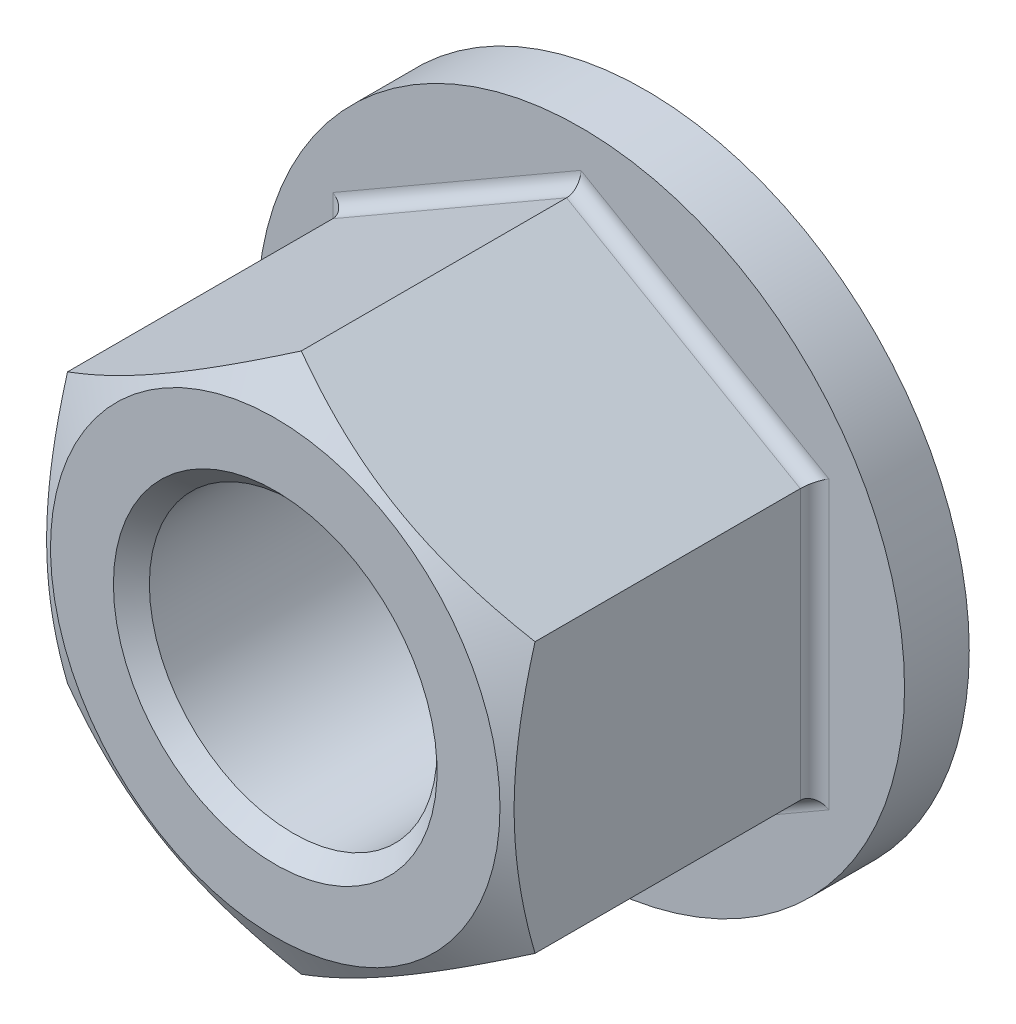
ISO-10303-21;
HEADER;
FILE_DESCRIPTION(('STEP AP214'),'2;1');
FILE_NAME('part.step','',(''),(''),'','','');
FILE_SCHEMA(('AUTOMOTIVE_DESIGN { 1 0 10303 214 1 1 1 1 }'));
ENDSEC;
DATA;
#1=APPLICATION_CONTEXT('core data for automotive mechanical design processes');
#2=APPLICATION_PROTOCOL_DEFINITION('international standard','automotive_design',2000,#1);
#3=PRODUCT_CONTEXT('',#1,'mechanical');
#4=PRODUCT('Part','Part','',(#3));
#5=PRODUCT_RELATED_PRODUCT_CATEGORY('part','',(#4));
#6=PRODUCT_DEFINITION_FORMATION('','',#4);
#7=PRODUCT_DEFINITION_CONTEXT('part definition',#1,'design');
#8=PRODUCT_DEFINITION('design','',#6,#7);
#9=PRODUCT_DEFINITION_SHAPE('','',#8);
#10=(LENGTH_UNIT() NAMED_UNIT(*) SI_UNIT(.MILLI.,.METRE.));
#11=(NAMED_UNIT(*) PLANE_ANGLE_UNIT() SI_UNIT($,.RADIAN.));
#12=(NAMED_UNIT(*) SI_UNIT($,.STERADIAN.) SOLID_ANGLE_UNIT());
#13=UNCERTAINTY_MEASURE_WITH_UNIT(LENGTH_MEASURE(1.E-05),#10,'distance_accuracy_value','');
#14=(GEOMETRIC_REPRESENTATION_CONTEXT(3) GLOBAL_UNCERTAINTY_ASSIGNED_CONTEXT((#13)) GLOBAL_UNIT_ASSIGNED_CONTEXT((#10,
#11,#12)) REPRESENTATION_CONTEXT('',''));
#15=CARTESIAN_POINT('',(0.,0.,0.));
#16=DIRECTION('',(0.,0.,1.));
#17=DIRECTION('',(1.,0.,0.));
#18=AXIS2_PLACEMENT_3D('',#15,#16,#17);
#19=CARTESIAN_POINT('',(-9.,0.,12.));
#20=DIRECTION('',(0.,0.,-1.));
#21=DIRECTION('',(-1.,0.,0.));
#22=AXIS2_PLACEMENT_3D('',#19,#20,#21);
#23=PLANE('',#22);
#24=CARTESIAN_POINT('',(0.,0.,12.));
#25=DIRECTION('',(0.,0.,-1.));
#26=DIRECTION('',(-1.,0.,0.));
#27=AXIS2_PLACEMENT_3D('',#24,#25,#26);
#28=CIRCLE('',#27,4.5);
#29=CARTESIAN_POINT('',(-4.5,0.,12.));
#30=VERTEX_POINT('',#29);
#31=EDGE_CURVE('E242',#30,#30,#28,.T.);
#32=ORIENTED_EDGE('',*,*,#31,.T.);
#33=EDGE_LOOP('',(#32));
#34=FACE_BOUND('',#33,.T.);
#35=CARTESIAN_POINT('',(0.,0.,12.));
#36=DIRECTION('',(0.,0.,1.));
#37=DIRECTION('',(1.,0.,0.));
#38=AXIS2_PLACEMENT_3D('',#35,#36,#37);
#39=CIRCLE('',#38,6.25);
#40=CARTESIAN_POINT('',(6.25,0.,12.));
#41=VERTEX_POINT('',#40);
#42=EDGE_CURVE('E109',#41,#41,#39,.T.);
#43=ORIENTED_EDGE('',*,*,#42,.T.);
#44=EDGE_LOOP('',(#43));
#45=FACE_BOUND('',#44,.T.);
#46=ADVANCED_FACE('F14',(#34,#45),#23,.F.);
#47=CARTESIAN_POINT('',(-6.5,-3.7527767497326,3.5));
#48=DIRECTION('',(-0.5,-0.86602540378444,0.));
#49=DIRECTION('',(0.86602540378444,-0.5,0.));
#50=AXIS2_PLACEMENT_3D('',#47,#48,#49);
#51=PLANE('',#50);
#52=DIRECTION('',(0.,0.,1.));
#53=VECTOR('',#52,1.);
#54=CARTESIAN_POINT('',(-6.5,-3.7527767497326,3.5));
#55=LINE('',#54,#53);
#56=CARTESIAN_POINT('',(-6.5,-3.7527767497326,3.9));
#57=VERTEX_POINT('',#56);
#58=CARTESIAN_POINT('',(-6.5,-3.7527767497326,11.2751058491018));
#59=VERTEX_POINT('',#58);
#60=EDGE_CURVE('E177',#57,#59,#55,.T.);
#61=ORIENTED_EDGE('',*,*,#60,.F.);
#62=DIRECTION('',(0.866025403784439,-0.5,0.));
#63=VECTOR('',#62,1.);
#64=CARTESIAN_POINT('',(0.,-7.50555349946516,3.9));
#65=LINE('',#64,#63);
#66=CARTESIAN_POINT('',(0.,-7.50555349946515,3.9));
#67=VERTEX_POINT('',#66);
#68=EDGE_CURVE('E179',#57,#67,#65,.T.);
#69=ORIENTED_EDGE('',*,*,#68,.T.);
#70=DIRECTION('',(0.,0.,1.));
#71=VECTOR('',#70,1.);
#72=CARTESIAN_POINT('',(0.,-7.50555349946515,3.5));
#73=LINE('',#72,#71);
#74=CARTESIAN_POINT('',(0.,-7.50555349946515,11.2751058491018));
#75=VERTEX_POINT('',#74);
#76=EDGE_CURVE('E91',#67,#75,#73,.T.);
#77=ORIENTED_EDGE('',*,*,#76,.T.);
#78=CARTESIAN_POINT('',(0.0002,-7.505668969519,11.2750391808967));
#79=CARTESIAN_POINT('',(-0.142677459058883,-7.42317863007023,11.3226580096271));
#80=CARTESIAN_POINT('',(-0.286087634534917,-7.34038072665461,11.3681157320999));
#81=CARTESIAN_POINT('',(-0.5740726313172,-7.17411251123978,11.4541137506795));
#82=CARTESIAN_POINT('',(-0.718647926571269,-7.09064192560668,11.4946519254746));
#83=CARTESIAN_POINT('',(-1.15468865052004,-6.83889369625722,11.6080914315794));
#84=CARTESIAN_POINT('',(-1.44787528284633,-6.66962231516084,11.6726146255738));
#85=CARTESIAN_POINT('',(-1.88662374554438,-6.41631077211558,11.7482758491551));
#86=CARTESIAN_POINT('',(-2.0308746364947,-6.33302748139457,11.7698295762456));
#87=CARTESIAN_POINT('',(-2.3200282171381,-6.16608458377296,11.8059721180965));
#88=CARTESIAN_POINT('',(-2.4649308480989,-6.08242501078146,11.8205615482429));
#89=CARTESIAN_POINT('',(-2.75498777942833,-5.91496056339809,11.8424036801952));
#90=CARTESIAN_POINT('',(-2.90014160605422,-5.83115596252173,11.8496647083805));
#91=CARTESIAN_POINT('',(-3.19057533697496,-5.6634739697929,11.8567021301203));
#92=CARTESIAN_POINT('',(-3.33585523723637,-5.57959658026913,11.8564787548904));
#93=CARTESIAN_POINT('',(-3.7338759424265,-5.34979921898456,11.8455789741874));
#94=CARTESIAN_POINT('',(-3.98648646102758,-5.2039544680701,11.8272806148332));
#95=CARTESIAN_POINT('',(-4.49002967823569,-4.91323365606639,11.7692560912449));
#96=CARTESIAN_POINT('',(-4.74096060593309,-4.76835861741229,11.7295100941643));
#97=CARTESIAN_POINT('',(-5.24551722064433,-4.47705272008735,11.6301565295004));
#98=CARTESIAN_POINT('',(-5.49907924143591,-4.33065861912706,11.5701280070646));
#99=CARTESIAN_POINT('',(-6.00242193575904,-4.04005357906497,11.4338874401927));
#100=CARTESIAN_POINT('',(-6.25220905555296,-3.89583891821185,11.357707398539));
#101=CARTESIAN_POINT('',(-6.5002,-3.75266127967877,11.2750391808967));
#102=B_SPLINE_CURVE_WITH_KNOTS('',3,(#78,#79,#80,#81,#82,#83,#84,#85,#86,#87,#88,#89,#90,#91,
#92,#93,#94,#95,#96,#97,#98,#99,#100,#101),.UNSPECIFIED.,.F.,.F.,(4,2,2,2,2,2,2,2,2,2,2,4),(0.,
0.515105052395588,1.03043143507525,2.06322554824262,2.56697389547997,3.07067772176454,
3.57380860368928,4.07692394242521,4.9527935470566,5.82947446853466,6.72559912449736,
7.61996451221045),.UNSPECIFIED.);
#103=EDGE_CURVE('E103',#75,#59,#102,.T.);
#104=ORIENTED_EDGE('',*,*,#103,.T.);
#105=EDGE_LOOP('',(#61,#69,#77,#104));
#106=FACE_BOUND('',#105,.T.);
#107=ADVANCED_FACE('F164',(#106),#51,.T.);
#108=CARTESIAN_POINT('',(-6.5,3.75277674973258,3.5));
#109=DIRECTION('',(-1.,0.,0.));
#110=DIRECTION('',(0.,0.,1.));
#111=AXIS2_PLACEMENT_3D('',#108,#109,#110);
#112=PLANE('',#111);
#113=DIRECTION('',(0.,0.,1.));
#114=VECTOR('',#113,1.);
#115=CARTESIAN_POINT('',(-6.5,3.75277674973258,3.5));
#116=LINE('',#115,#114);
#117=CARTESIAN_POINT('',(-6.5,3.75277674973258,3.9));
#118=VERTEX_POINT('',#117);
#119=CARTESIAN_POINT('',(-6.5,3.75277674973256,11.2751058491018));
#120=VERTEX_POINT('',#119);
#121=EDGE_CURVE('E181',#118,#120,#116,.T.);
#122=ORIENTED_EDGE('',*,*,#121,.F.);
#123=DIRECTION('',(0.,-1.,0.));
#124=VECTOR('',#123,1.);
#125=CARTESIAN_POINT('',(-6.5,-3.7527767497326,3.9));
#126=LINE('',#125,#124);
#127=EDGE_CURVE('E193',#118,#57,#126,.T.);
#128=ORIENTED_EDGE('',*,*,#127,.T.);
#129=ORIENTED_EDGE('',*,*,#60,.T.);
#130=CARTESIAN_POINT('',(-6.5,-10.0336555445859,8.70616314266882));
#131=CARTESIAN_POINT('',(-6.5,-9.75014486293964,8.84350254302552));
#132=CARTESIAN_POINT('',(-6.5,-9.46597830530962,8.97951146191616));
#133=CARTESIAN_POINT('',(-6.5,-8.89598446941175,9.24811908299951));
#134=CARTESIAN_POINT('',(-6.5,-8.61015693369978,9.38071723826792));
#135=CARTESIAN_POINT('',(-6.5,-8.03499695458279,9.64243120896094));
#136=CARTESIAN_POINT('',(-6.5,-7.74565387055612,9.77152372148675));
#137=CARTESIAN_POINT('',(-6.5,-7.16464988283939,10.0243628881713));
#138=CARTESIAN_POINT('',(-6.5,-6.87298909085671,10.1481097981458));
#139=CARTESIAN_POINT('',(-6.5,-6.27765749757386,10.3926353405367));
#140=CARTESIAN_POINT('',(-6.5,-5.97389753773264,10.5131980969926));
#141=CARTESIAN_POINT('',(-6.5,-5.36280630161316,10.7450850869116));
#142=CARTESIAN_POINT('',(-6.5,-5.05547462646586,10.8564082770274));
#143=CARTESIAN_POINT('',(-6.5,-4.43734273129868,11.0668597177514));
#144=CARTESIAN_POINT('',(-6.5,-4.12655114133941,11.1660130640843));
#145=CARTESIAN_POINT('',(-6.5,-3.50050708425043,11.3489111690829));
#146=CARTESIAN_POINT('',(-6.5,-3.18525607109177,11.4326608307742));
#147=CARTESIAN_POINT('',(-6.5,-2.55186849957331,11.5802633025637));
#148=CARTESIAN_POINT('',(-6.5,-2.23375704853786,11.6442221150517));
#149=CARTESIAN_POINT('',(-6.5,-1.59358295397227,11.7485794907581));
#150=CARTESIAN_POINT('',(-6.5,-1.27152067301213,11.7889801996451));
#151=CARTESIAN_POINT('',(-6.5,-0.788883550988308,11.8292288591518));
#152=CARTESIAN_POINT('',(-6.5,-0.629116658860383,11.839252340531));
#153=CARTESIAN_POINT('',(-6.5,-0.309295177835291,11.8525431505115));
#154=CARTESIAN_POINT('',(-6.5,-0.149240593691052,11.8558105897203));
#155=CARTESIAN_POINT('',(-6.5,0.17086186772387,11.8555038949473));
#156=CARTESIAN_POINT('',(-6.5,0.330909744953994,11.8519297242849));
#157=CARTESIAN_POINT('',(-6.5,0.650714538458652,11.8380283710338));
#158=CARTESIAN_POINT('',(-6.5,0.810471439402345,11.8277008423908));
#159=CARTESIAN_POINT('',(-6.5,1.19584370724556,11.7948591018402));
#160=CARTESIAN_POINT('',(-6.5,1.42118493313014,11.7690611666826));
#161=CARTESIAN_POINT('',(-6.5,1.87015348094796,11.7054465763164));
#162=CARTESIAN_POINT('',(-6.5,2.09378055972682,11.6676282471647));
#163=CARTESIAN_POINT('',(-6.5,2.76185802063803,11.5381514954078));
#164=CARTESIAN_POINT('',(-6.5,3.2032468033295,11.4304961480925));
#165=CARTESIAN_POINT('',(-6.5,3.86318247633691,11.2443343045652));
#166=CARTESIAN_POINT('',(-6.5,4.0851654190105,11.1773124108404));
#167=CARTESIAN_POINT('',(-6.5,4.52697435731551,11.0364377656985));
#168=CARTESIAN_POINT('',(-6.5,4.74680033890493,10.9625849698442));
#169=CARTESIAN_POINT('',(-6.5,5.1843670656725,10.809222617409));
#170=CARTESIAN_POINT('',(-6.5,5.40210850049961,10.7297150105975));
#171=CARTESIAN_POINT('',(-6.5,5.83579609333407,10.56596551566));
#172=CARTESIAN_POINT('',(-6.5,6.05174227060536,10.4817236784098));
#173=CARTESIAN_POINT('',(-6.5,6.55408961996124,10.2804224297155));
#174=CARTESIAN_POINT('',(-6.5,6.83987095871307,10.1618192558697));
#175=CARTESIAN_POINT('',(-6.5,7.40906697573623,9.9190479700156));
#176=CARTESIAN_POINT('',(-6.5,7.69248151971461,9.79487954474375));
#177=CARTESIAN_POINT('',(-6.5,8.25736986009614,9.54207515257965));
#178=CARTESIAN_POINT('',(-6.5,8.5388432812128,9.41343834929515));
#179=CARTESIAN_POINT('',(-6.5,9.10012451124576,9.15257463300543));
#180=CARTESIAN_POINT('',(-6.5,9.37993228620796,9.02034764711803));
#181=CARTESIAN_POINT('',(-6.5,9.93842785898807,8.75283283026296));
#182=CARTESIAN_POINT('',(-6.5,10.2171142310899,8.61754202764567));
#183=CARTESIAN_POINT('',(-6.5,10.773300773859,8.3445415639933));
#184=CARTESIAN_POINT('',(-6.5,11.050800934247,8.20683188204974));
#185=CARTESIAN_POINT('',(-6.5,11.8817317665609,7.7907418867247));
#186=CARTESIAN_POINT('',(-6.5,12.4336627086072,7.50936686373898));
#187=CARTESIAN_POINT('',(-6.5,13.4896513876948,6.9641769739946));
#188=CARTESIAN_POINT('',(-6.5,13.993938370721,6.70080419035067));
#189=CARTESIAN_POINT('',(-6.5,15.000633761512,6.17045514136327));
#190=CARTESIAN_POINT('',(-6.5,15.5030421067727,5.90347875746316));
#191=CARTESIAN_POINT('',(-6.5,16.5051942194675,5.36741260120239));
#192=CARTESIAN_POINT('',(-6.5,17.0049414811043,5.09832935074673));
#193=CARTESIAN_POINT('',(-6.5,18.0032306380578,4.55799772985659));
#194=CARTESIAN_POINT('',(-6.5,18.5017725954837,4.2867494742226));
#195=CARTESIAN_POINT('',(-6.5,18.9998688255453,4.01469064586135));
#196=B_SPLINE_CURVE_WITH_KNOTS('',3,(#130,#131,#132,#133,#134,#135,#136,#137,#138,#139,#140,
#141,#142,#143,#144,#145,#146,#147,#148,#149,#150,#151,#152,#153,#154,#155,#156,#157,#158,#159,
#160,#161,#162,#163,#164,#165,#166,#167,#168,#169,#170,#171,#172,#173,#174,#175,#176,#177,#178,
#179,#180,#181,#182,#183,#184,#185,#186,#187,#188,#189,#190,#191,#192,#193,#194,#195),
.UNSPECIFIED.,.F.,.F.,(4,2,2,2,2,2,2,2,2,2,2,2,2,2,2,2,2,2,2,2,2,2,2,2,2,2,2,2,2,2,2,2,4),(0.,
0.945085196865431,1.89032100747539,2.84078217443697,3.79119780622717,4.77151507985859,
5.75194290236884,6.73031372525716,7.70837258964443,8.68109834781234,9.6537354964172,
10.13385737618,10.6139713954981,11.0940879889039,11.5742291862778,12.2542834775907,
12.9344325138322,14.2955041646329,14.9910880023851,15.686676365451,16.382026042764,
17.0773682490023,18.0055347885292,18.933753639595,19.8621471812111,20.7905595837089,
21.7199146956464,22.6492778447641,24.507771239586,26.2145172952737,27.9213196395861,
29.6240699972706,31.326730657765),.UNSPECIFIED.);
#197=EDGE_CURVE('E152',#59,#120,#196,.T.);
#198=ORIENTED_EDGE('',*,*,#197,.T.);
#199=EDGE_LOOP('',(#122,#128,#129,#198));
#200=FACE_BOUND('',#199,.T.);
#201=ADVANCED_FACE('F142',(#200),#112,.T.);
#202=CARTESIAN_POINT('',(0.,7.50555349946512,3.5));
#203=DIRECTION('',(-0.5,0.86602540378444,0.));
#204=DIRECTION('',(-0.86602540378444,-0.5,0.));
#205=AXIS2_PLACEMENT_3D('',#202,#203,#204);
#206=PLANE('',#205);
#207=DIRECTION('',(0.,0.,1.));
#208=VECTOR('',#207,1.);
#209=CARTESIAN_POINT('',(0.,7.50555349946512,3.5));
#210=LINE('',#209,#208);
#211=CARTESIAN_POINT('',(0.,7.50555349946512,3.9));
#212=VERTEX_POINT('',#211);
#213=CARTESIAN_POINT('',(0.,7.50555349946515,11.2751058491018));
#214=VERTEX_POINT('',#213);
#215=EDGE_CURVE('E264',#212,#214,#210,.T.);
#216=ORIENTED_EDGE('',*,*,#215,.F.);
#217=DIRECTION('',(-0.866025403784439,-0.5,0.));
#218=VECTOR('',#217,1.);
#219=CARTESIAN_POINT('',(-6.5,3.75277674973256,3.9));
#220=LINE('',#219,#218);
#221=EDGE_CURVE('E236',#212,#118,#220,.T.);
#222=ORIENTED_EDGE('',*,*,#221,.T.);
#223=ORIENTED_EDGE('',*,*,#121,.T.);
#224=CARTESIAN_POINT('',(-6.5002,3.75266127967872,11.2750391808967));
#225=CARTESIAN_POINT('',(-6.35732254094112,3.83515161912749,11.3226580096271));
#226=CARTESIAN_POINT('',(-6.21391236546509,3.91794952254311,11.3681157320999));
#227=CARTESIAN_POINT('',(-5.9259273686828,4.08421773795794,11.4541137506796));
#228=CARTESIAN_POINT('',(-5.78135207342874,4.16768832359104,11.4946519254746));
#229=CARTESIAN_POINT('',(-5.34531134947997,4.4194365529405,11.6080914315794));
#230=CARTESIAN_POINT('',(-5.05212471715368,4.58870793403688,11.6726146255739));
#231=CARTESIAN_POINT('',(-4.61337625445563,4.84201947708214,11.7482758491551));
#232=CARTESIAN_POINT('',(-4.46912536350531,4.92530276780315,11.7698295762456));
#233=CARTESIAN_POINT('',(-4.17997178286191,5.09224566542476,11.8059721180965));
#234=CARTESIAN_POINT('',(-4.03506915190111,5.17590523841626,11.8205615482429));
#235=CARTESIAN_POINT('',(-3.74501222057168,5.34336968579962,11.8424036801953));
#236=CARTESIAN_POINT('',(-3.59985839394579,5.42717428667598,11.8496647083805));
#237=CARTESIAN_POINT('',(-3.30942466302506,5.59485627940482,11.8567021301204));
#238=CARTESIAN_POINT('',(-3.16414476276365,5.67873366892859,11.8564787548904));
#239=CARTESIAN_POINT('',(-2.76612405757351,5.90853103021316,11.8455789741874));
#240=CARTESIAN_POINT('',(-2.51351353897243,6.05437578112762,11.8272806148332));
#241=CARTESIAN_POINT('',(-2.00997032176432,6.34509659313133,11.7692560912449));
#242=CARTESIAN_POINT('',(-1.75903939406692,6.48997163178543,11.7295100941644));
#243=CARTESIAN_POINT('',(-1.25448277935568,6.78127752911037,11.6301565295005));
#244=CARTESIAN_POINT('',(-1.00092075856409,6.92767163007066,11.5701280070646));
#245=CARTESIAN_POINT('',(-0.497578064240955,7.21827667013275,11.4338874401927));
#246=CARTESIAN_POINT('',(-0.247790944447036,7.36249133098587,11.357707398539));
#247=CARTESIAN_POINT('',(0.000199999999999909,7.50566896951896,11.2750391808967));
#248=B_SPLINE_CURVE_WITH_KNOTS('',3,(#224,#225,#226,#227,#228,#229,#230,#231,#232,#233,#234,
#235,#236,#237,#238,#239,#240,#241,#242,#243,#244,#245,#246,#247),.UNSPECIFIED.,.F.,.F.,(4,2,2,
2,2,2,2,2,2,2,2,4),(0.,0.515105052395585,1.03043143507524,2.06322554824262,2.56697389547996,
3.07067772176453,3.57380860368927,4.07692394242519,4.9527935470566,5.82947446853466,
6.72559912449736,7.61996451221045),.UNSPECIFIED.);
#249=EDGE_CURVE('E111',#120,#214,#248,.T.);
#250=ORIENTED_EDGE('',*,*,#249,.T.);
#251=EDGE_LOOP('',(#216,#222,#223,#250));
#252=FACE_BOUND('',#251,.T.);
#253=ADVANCED_FACE('F137',(#252),#206,.T.);
#254=CARTESIAN_POINT('',(6.5,3.75277674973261,3.5));
#255=DIRECTION('',(0.5,0.866025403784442,0.));
#256=DIRECTION('',(-0.866025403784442,0.5,0.));
#257=AXIS2_PLACEMENT_3D('',#254,#255,#256);
#258=PLANE('',#257);
#259=DIRECTION('',(0.,0.,1.));
#260=VECTOR('',#259,1.);
#261=CARTESIAN_POINT('',(6.5,3.75277674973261,3.5));
#262=LINE('',#261,#260);
#263=CARTESIAN_POINT('',(6.5,3.75277674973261,3.9));
#264=VERTEX_POINT('',#263);
#265=CARTESIAN_POINT('',(6.5,3.75277674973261,11.2751058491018));
#266=VERTEX_POINT('',#265);
#267=EDGE_CURVE('E90',#264,#266,#262,.T.);
#268=ORIENTED_EDGE('',*,*,#267,.F.);
#269=DIRECTION('',(-0.866025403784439,0.5,0.));
#270=VECTOR('',#269,1.);
#271=CARTESIAN_POINT('',(0.,7.50555349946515,3.9));
#272=LINE('',#271,#270);
#273=EDGE_CURVE('E9',#264,#212,#272,.T.);
#274=ORIENTED_EDGE('',*,*,#273,.T.);
#275=ORIENTED_EDGE('',*,*,#215,.T.);
#276=CARTESIAN_POINT('',(-0.000199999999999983,7.505668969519,11.2750391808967));
#277=CARTESIAN_POINT('',(0.142677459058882,7.42317863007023,11.3226580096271));
#278=CARTESIAN_POINT('',(0.286087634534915,7.34038072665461,11.3681157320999));
#279=CARTESIAN_POINT('',(0.574072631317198,7.17411251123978,11.4541137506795));
#280=CARTESIAN_POINT('',(0.718647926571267,7.09064192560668,11.4946519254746));
#281=CARTESIAN_POINT('',(1.15468865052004,6.83889369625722,11.6080914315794));
#282=CARTESIAN_POINT('',(1.44787528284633,6.66962231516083,11.6726146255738));
#283=CARTESIAN_POINT('',(1.88662374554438,6.41631077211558,11.7482758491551));
#284=CARTESIAN_POINT('',(2.0308746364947,6.33302748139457,11.7698295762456));
#285=CARTESIAN_POINT('',(2.3200282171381,6.16608458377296,11.8059721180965));
#286=CARTESIAN_POINT('',(2.4649308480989,6.08242501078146,11.8205615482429));
#287=CARTESIAN_POINT('',(2.75498777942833,5.91496056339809,11.8424036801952));
#288=CARTESIAN_POINT('',(2.90014160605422,5.83115596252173,11.8496647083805));
#289=CARTESIAN_POINT('',(3.19057533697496,5.6634739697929,11.8567021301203));
#290=CARTESIAN_POINT('',(3.33585523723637,5.57959658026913,11.8564787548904));
#291=CARTESIAN_POINT('',(3.73387594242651,5.34979921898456,11.8455789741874));
#292=CARTESIAN_POINT('',(3.98648646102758,5.2039544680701,11.8272806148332));
#293=CARTESIAN_POINT('',(4.49002967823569,4.91323365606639,11.7692560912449));
#294=CARTESIAN_POINT('',(4.74096060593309,4.76835861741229,11.7295100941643));
#295=CARTESIAN_POINT('',(5.24551722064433,4.47705272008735,11.6301565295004));
#296=CARTESIAN_POINT('',(5.49907924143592,4.33065861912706,11.5701280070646));
#297=CARTESIAN_POINT('',(6.00242193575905,4.04005357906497,11.4338874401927));
#298=CARTESIAN_POINT('',(6.25220905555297,3.89583891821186,11.357707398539));
#299=CARTESIAN_POINT('',(6.5002,3.75266127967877,11.2750391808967));
#300=B_SPLINE_CURVE_WITH_KNOTS('',3,(#276,#277,#278,#279,#280,#281,#282,#283,#284,#285,#286,
#287,#288,#289,#290,#291,#292,#293,#294,#295,#296,#297,#298,#299),.UNSPECIFIED.,.F.,.F.,(4,2,2,
2,2,2,2,2,2,2,2,4),(0.,0.515105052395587,1.03043143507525,2.06322554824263,2.56697389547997,
3.07067772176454,3.57380860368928,4.07692394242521,4.95279354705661,5.82947446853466,
6.72559912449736,7.61996451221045),.UNSPECIFIED.);
#301=EDGE_CURVE('E108',#214,#266,#300,.T.);
#302=ORIENTED_EDGE('',*,*,#301,.T.);
#303=EDGE_LOOP('',(#268,#274,#275,#302));
#304=FACE_BOUND('',#303,.T.);
#305=ADVANCED_FACE('F132',(#304),#258,.T.);
#306=CARTESIAN_POINT('',(6.5,-3.75277674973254,3.5));
#307=DIRECTION('',(1.,0.,0.));
#308=DIRECTION('',(0.,0.,-1.));
#309=AXIS2_PLACEMENT_3D('',#306,#307,#308);
#310=PLANE('',#309);
#311=DIRECTION('',(0.,0.,1.));
#312=VECTOR('',#311,1.);
#313=CARTESIAN_POINT('',(6.5,-3.75277674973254,3.5));
#314=LINE('',#313,#312);
#315=CARTESIAN_POINT('',(6.5,-3.75277674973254,3.9));
#316=VERTEX_POINT('',#315);
#317=CARTESIAN_POINT('',(6.5,-3.75277674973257,11.2751058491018));
#318=VERTEX_POINT('',#317);
#319=EDGE_CURVE('E84',#316,#318,#314,.T.);
#320=ORIENTED_EDGE('',*,*,#319,.F.);
#321=DIRECTION('',(0.,1.,0.));
#322=VECTOR('',#321,1.);
#323=CARTESIAN_POINT('',(6.5,3.75277674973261,3.9));
#324=LINE('',#323,#322);
#325=EDGE_CURVE('E23',#316,#264,#324,.T.);
#326=ORIENTED_EDGE('',*,*,#325,.T.);
#327=ORIENTED_EDGE('',*,*,#267,.T.);
#328=CARTESIAN_POINT('',(6.5,-10.0336555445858,8.70616314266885));
#329=CARTESIAN_POINT('',(6.5,-9.75014486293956,8.84350254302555));
#330=CARTESIAN_POINT('',(6.5,-9.46597830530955,8.97951146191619));
#331=CARTESIAN_POINT('',(6.5,-8.89598446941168,9.24811908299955));
#332=CARTESIAN_POINT('',(6.5,-8.61015693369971,9.38071723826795));
#333=CARTESIAN_POINT('',(6.5,-8.03499695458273,9.64243120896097));
#334=CARTESIAN_POINT('',(6.5,-7.74565387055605,9.77152372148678));
#335=CARTESIAN_POINT('',(6.5,-7.16464988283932,10.0243628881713));
#336=CARTESIAN_POINT('',(6.5,-6.87298909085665,10.1481097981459));
#337=CARTESIAN_POINT('',(6.5,-6.2776574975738,10.3926353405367));
#338=CARTESIAN_POINT('',(6.5,-5.97389753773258,10.5131980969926));
#339=CARTESIAN_POINT('',(6.5,-5.36280630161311,10.7450850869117));
#340=CARTESIAN_POINT('',(6.5,-5.05547462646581,10.8564082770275));
#341=CARTESIAN_POINT('',(6.5,-4.43734273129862,11.0668597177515));
#342=CARTESIAN_POINT('',(6.5,-4.12655114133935,11.1660130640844));
#343=CARTESIAN_POINT('',(6.5,-3.50050708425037,11.3489111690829));
#344=CARTESIAN_POINT('',(6.5,-3.18525607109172,11.4326608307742));
#345=CARTESIAN_POINT('',(6.5,-2.55186849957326,11.5802633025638));
#346=CARTESIAN_POINT('',(6.5,-2.23375704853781,11.6442221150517));
#347=CARTESIAN_POINT('',(6.5,-1.59358295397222,11.7485794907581));
#348=CARTESIAN_POINT('',(6.5,-1.27152067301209,11.7889801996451));
#349=CARTESIAN_POINT('',(6.5,-0.788883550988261,11.8292288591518));
#350=CARTESIAN_POINT('',(6.5,-0.629116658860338,11.839252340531));
#351=CARTESIAN_POINT('',(6.5,-0.309295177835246,11.8525431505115));
#352=CARTESIAN_POINT('',(6.5,-0.149240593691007,11.8558105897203));
#353=CARTESIAN_POINT('',(6.5,0.170861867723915,11.8555038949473));
#354=CARTESIAN_POINT('',(6.5,0.330909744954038,11.8519297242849));
#355=CARTESIAN_POINT('',(6.5,0.650714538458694,11.8380283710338));
#356=CARTESIAN_POINT('',(6.5,0.810471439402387,11.8277008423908));
#357=CARTESIAN_POINT('',(6.5,1.1958437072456,11.7948591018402));
#358=CARTESIAN_POINT('',(6.5,1.42118493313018,11.7690611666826));
#359=CARTESIAN_POINT('',(6.5,1.870153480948,11.7054465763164));
#360=CARTESIAN_POINT('',(6.5,2.09378055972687,11.6676282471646));
#361=CARTESIAN_POINT('',(6.5,2.76185802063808,11.5381514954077));
#362=CARTESIAN_POINT('',(6.5,3.20324680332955,11.4304961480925));
#363=CARTESIAN_POINT('',(6.5,3.86318247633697,11.2443343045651));
#364=CARTESIAN_POINT('',(6.5,4.08516541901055,11.1773124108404));
#365=CARTESIAN_POINT('',(6.5,4.52697435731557,11.0364377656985));
#366=CARTESIAN_POINT('',(6.5,4.74680033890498,10.9625849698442));
#367=CARTESIAN_POINT('',(6.5,5.18436706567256,10.809222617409));
#368=CARTESIAN_POINT('',(6.5,5.40210850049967,10.7297150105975));
#369=CARTESIAN_POINT('',(6.5,5.83579609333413,10.56596551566));
#370=CARTESIAN_POINT('',(6.5,6.05174227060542,10.4817236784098));
#371=CARTESIAN_POINT('',(6.5,6.5540896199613,10.2804224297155));
#372=CARTESIAN_POINT('',(6.5,6.83987095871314,10.1618192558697));
#373=CARTESIAN_POINT('',(6.5,7.4090669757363,9.91904797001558));
#374=CARTESIAN_POINT('',(6.5,7.69248151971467,9.79487954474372));
#375=CARTESIAN_POINT('',(6.5,8.2573698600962,9.54207515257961));
#376=CARTESIAN_POINT('',(6.5,8.53884328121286,9.41343834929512));
#377=CARTESIAN_POINT('',(6.5,9.10012451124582,9.1525746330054));
#378=CARTESIAN_POINT('',(6.5,9.37993228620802,9.020347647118));
#379=CARTESIAN_POINT('',(6.5,9.93842785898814,8.75283283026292));
#380=CARTESIAN_POINT('',(6.5,10.21711423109,8.61754202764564));
#381=CARTESIAN_POINT('',(6.5,10.7733007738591,8.34454156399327));
#382=CARTESIAN_POINT('',(6.5,11.050800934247,8.2068318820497));
#383=CARTESIAN_POINT('',(6.5,11.881731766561,7.79074188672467));
#384=CARTESIAN_POINT('',(6.5,12.4336627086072,7.50936686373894));
#385=CARTESIAN_POINT('',(6.5,13.4896513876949,6.96417697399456));
#386=CARTESIAN_POINT('',(6.5,13.9939383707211,6.70080419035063));
#387=CARTESIAN_POINT('',(6.5,15.0006337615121,6.17045514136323));
#388=CARTESIAN_POINT('',(6.5,15.5030421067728,5.90347875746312));
#389=CARTESIAN_POINT('',(6.5,16.5051942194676,5.36741260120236));
#390=CARTESIAN_POINT('',(6.5,17.0049414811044,5.09832935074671));
#391=CARTESIAN_POINT('',(6.5,18.0032306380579,4.55799772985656));
#392=CARTESIAN_POINT('',(6.5,18.5017725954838,4.28674947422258));
#393=CARTESIAN_POINT('',(6.5,18.9998688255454,4.01469064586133));
#394=B_SPLINE_CURVE_WITH_KNOTS('',3,(#328,#329,#330,#331,#332,#333,#334,#335,#336,#337,#338,
#339,#340,#341,#342,#343,#344,#345,#346,#347,#348,#349,#350,#351,#352,#353,#354,#355,#356,#357,
#358,#359,#360,#361,#362,#363,#364,#365,#366,#367,#368,#369,#370,#371,#372,#373,#374,#375,#376,
#377,#378,#379,#380,#381,#382,#383,#384,#385,#386,#387,#388,#389,#390,#391,#392,#393),
.UNSPECIFIED.,.F.,.F.,(4,2,2,2,2,2,2,2,2,2,2,2,2,2,2,2,2,2,2,2,2,2,2,2,2,2,2,2,2,2,2,2,4),(0.,
0.945085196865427,1.89032100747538,2.84078217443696,3.79119780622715,4.77151507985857,
5.75194290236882,6.73031372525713,7.7083725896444,8.68109834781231,9.65373549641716,
10.13385737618,10.6139713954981,11.0940879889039,11.5742291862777,12.2542834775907,
12.9344325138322,14.2955041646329,14.9910880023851,15.686676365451,16.382026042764,
17.0773682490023,18.0055347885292,18.933753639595,19.8621471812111,20.7905595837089,
21.7199146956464,22.6492778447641,24.507771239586,26.2145172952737,27.9213196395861,
29.6240699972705,31.326730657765),.UNSPECIFIED.);
#395=EDGE_CURVE('E99',#266,#318,#394,.F.);
#396=ORIENTED_EDGE('',*,*,#395,.T.);
#397=EDGE_LOOP('',(#320,#326,#327,#396));
#398=FACE_BOUND('',#397,.T.);
#399=ADVANCED_FACE('F107',(#398),#310,.T.);
#400=CARTESIAN_POINT('',(0.,-7.50555349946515,3.5));
#401=DIRECTION('',(0.5,-0.866025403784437,0.));
#402=DIRECTION('',(0.866025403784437,0.5,0.));
#403=AXIS2_PLACEMENT_3D('',#400,#401,#402);
#404=PLANE('',#403);
#405=ORIENTED_EDGE('',*,*,#76,.F.);
#406=DIRECTION('',(0.866025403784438,0.5,0.));
#407=VECTOR('',#406,1.);
#408=CARTESIAN_POINT('',(6.5,-3.75277674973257,3.9));
#409=LINE('',#408,#407);
#410=EDGE_CURVE('E38',#67,#316,#409,.T.);
#411=ORIENTED_EDGE('',*,*,#410,.T.);
#412=ORIENTED_EDGE('',*,*,#319,.T.);
#413=CARTESIAN_POINT('',(6.5002,-3.75266127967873,11.2750391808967));
#414=CARTESIAN_POINT('',(6.35732254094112,-3.83515161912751,11.3226580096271));
#415=CARTESIAN_POINT('',(6.21391236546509,-3.91794952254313,11.3681157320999));
#416=CARTESIAN_POINT('',(5.92592736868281,-4.08421773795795,11.4541137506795));
#417=CARTESIAN_POINT('',(5.78135207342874,-4.16768832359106,11.4946519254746));
#418=CARTESIAN_POINT('',(5.34531134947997,-4.41943655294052,11.6080914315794));
#419=CARTESIAN_POINT('',(5.05212471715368,-4.5887079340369,11.6726146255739));
#420=CARTESIAN_POINT('',(4.61337625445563,-4.84201947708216,11.7482758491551));
#421=CARTESIAN_POINT('',(4.46912536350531,-4.92530276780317,11.7698295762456));
#422=CARTESIAN_POINT('',(4.17997178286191,-5.09224566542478,11.8059721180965));
#423=CARTESIAN_POINT('',(4.03506915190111,-5.17590523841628,11.8205615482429));
#424=CARTESIAN_POINT('',(3.74501222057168,-5.34336968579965,11.8424036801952));
#425=CARTESIAN_POINT('',(3.59985839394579,-5.42717428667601,11.8496647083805));
#426=CARTESIAN_POINT('',(3.30942466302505,-5.59485627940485,11.8567021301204));
#427=CARTESIAN_POINT('',(3.16414476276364,-5.67873366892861,11.8564787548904));
#428=CARTESIAN_POINT('',(2.76612405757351,-5.90853103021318,11.8455789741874));
#429=CARTESIAN_POINT('',(2.51351353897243,-6.05437578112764,11.8272806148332));
#430=CARTESIAN_POINT('',(2.00997032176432,-6.34509659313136,11.7692560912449));
#431=CARTESIAN_POINT('',(1.75903939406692,-6.48997163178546,11.7295100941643));
#432=CARTESIAN_POINT('',(1.25448277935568,-6.7812775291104,11.6301565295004));
#433=CARTESIAN_POINT('',(1.00092075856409,-6.92767163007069,11.5701280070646));
#434=CARTESIAN_POINT('',(0.497578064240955,-7.21827667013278,11.4338874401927));
#435=CARTESIAN_POINT('',(0.247790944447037,-7.3624913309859,11.357707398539));
#436=CARTESIAN_POINT('',(-0.000199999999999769,-7.50566896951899,11.2750391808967));
#437=B_SPLINE_CURVE_WITH_KNOTS('',3,(#413,#414,#415,#416,#417,#418,#419,#420,#421,#422,#423,
#424,#425,#426,#427,#428,#429,#430,#431,#432,#433,#434,#435,#436),.UNSPECIFIED.,.F.,.F.,(4,2,2,
2,2,2,2,2,2,2,2,4),(0.,0.515105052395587,1.03043143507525,2.06322554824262,2.56697389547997,
3.07067772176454,3.57380860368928,4.0769239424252,4.9527935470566,5.82947446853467,
6.72559912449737,7.61996451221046),.UNSPECIFIED.);
#438=EDGE_CURVE('E87',#318,#75,#437,.T.);
#439=ORIENTED_EDGE('',*,*,#438,.T.);
#440=EDGE_LOOP('',(#405,#411,#412,#439));
#441=FACE_BOUND('',#440,.T.);
#442=ADVANCED_FACE('F86',(#441),#404,.T.);
#443=CARTESIAN_POINT('',(0.,0.,20.));
#444=DIRECTION('',(0.,0.,1.));
#445=DIRECTION('',(1.,0.,0.));
#446=AXIS2_PLACEMENT_3D('',#443,#444,#445);
#447=CYLINDRICAL_SURFACE('',#446,9.);
#448=CARTESIAN_POINT('',(0.,0.,1.7));
#449=DIRECTION('',(0.,0.,1.));
#450=DIRECTION('',(1.,0.,0.));
#451=AXIS2_PLACEMENT_3D('',#448,#449,#450);
#452=CIRCLE('',#451,9.);
#453=CARTESIAN_POINT('',(9.,0.,1.7));
#454=VERTEX_POINT('',#453);
#455=EDGE_CURVE('E255',#454,#454,#452,.T.);
#456=ORIENTED_EDGE('',*,*,#455,.T.);
#457=EDGE_LOOP('',(#456));
#458=FACE_BOUND('',#457,.T.);
#459=CARTESIAN_POINT('',(0.,0.,3.5));
#460=DIRECTION('',(0.,0.,1.));
#461=DIRECTION('',(1.,0.,0.));
#462=AXIS2_PLACEMENT_3D('',#459,#460,#461);
#463=CIRCLE('',#462,9.);
#464=CARTESIAN_POINT('',(9.,0.,3.5));
#465=VERTEX_POINT('',#464);
#466=EDGE_CURVE('E180',#465,#465,#463,.T.);
#467=ORIENTED_EDGE('',*,*,#466,.F.);
#468=EDGE_LOOP('',(#467));
#469=FACE_BOUND('',#468,.T.);
#470=ADVANCED_FACE('F376',(#458,#469),#447,.T.);
#471=CARTESIAN_POINT('',(0.,0.,20.));
#472=DIRECTION('',(0.,0.,1.));
#473=DIRECTION('',(1.,0.,0.));
#474=AXIS2_PLACEMENT_3D('',#471,#472,#473);
#475=CYLINDRICAL_SURFACE('',#474,4.);
#476=CARTESIAN_POINT('',(0.,0.,11.5));
#477=DIRECTION('',(0.,0.,-1.));
#478=DIRECTION('',(-1.,0.,0.));
#479=AXIS2_PLACEMENT_3D('',#476,#477,#478);
#480=CIRCLE('',#479,4.);
#481=CARTESIAN_POINT('',(-4.,0.,11.5));
#482=VERTEX_POINT('',#481);
#483=EDGE_CURVE('E104',#482,#482,#480,.F.);
#484=ORIENTED_EDGE('',*,*,#483,.T.);
#485=EDGE_LOOP('',(#484));
#486=FACE_BOUND('',#485,.T.);
#487=CARTESIAN_POINT('',(0.,0.,0.));
#488=DIRECTION('',(0.,0.,1.));
#489=DIRECTION('',(1.,0.,0.));
#490=AXIS2_PLACEMENT_3D('',#487,#488,#489);
#491=CIRCLE('',#490,4.);
#492=CARTESIAN_POINT('',(4.,0.,0.));
#493=VERTEX_POINT('',#492);
#494=EDGE_CURVE('E105',#493,#493,#491,.T.);
#495=ORIENTED_EDGE('',*,*,#494,.F.);
#496=EDGE_LOOP('',(#495));
#497=FACE_BOUND('',#496,.T.);
#498=ADVANCED_FACE('F366',(#486,#497),#475,.F.);
#499=CARTESIAN_POINT('',(-4.,0.,0.));
#500=DIRECTION('',(0.,0.,1.));
#501=DIRECTION('',(1.,0.,0.));
#502=AXIS2_PLACEMENT_3D('',#499,#500,#501);
#503=PLANE('',#502);
#504=CARTESIAN_POINT('',(0.,0.,0.));
#505=DIRECTION('',(0.,0.,1.));
#506=DIRECTION('',(1.,0.,0.));
#507=AXIS2_PLACEMENT_3D('',#504,#505,#506);
#508=CIRCLE('',#507,4.16941941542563);
#509=CARTESIAN_POINT('',(4.16941941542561,0.,0.));
#510=VERTEX_POINT('',#509);
#511=EDGE_CURVE('E258',#510,#510,#508,.T.);
#512=ORIENTED_EDGE('',*,*,#511,.F.);
#513=EDGE_LOOP('',(#512));
#514=FACE_BOUND('',#513,.T.);
#515=ORIENTED_EDGE('',*,*,#494,.T.);
#516=EDGE_LOOP('',(#515));
#517=FACE_BOUND('',#516,.T.);
#518=ADVANCED_FACE('F356',(#514,#517),#503,.F.);
#519=CARTESIAN_POINT('',(0.,0.,19.5605710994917));
#520=DIRECTION('',(0.,0.,1.));
#521=DIRECTION('',(1.,0.,0.));
#522=AXIS2_PLACEMENT_3D('',#519,#520,#521);
#523=SPHERICAL_SURFACE('',#522,20.);
#524=CARTESIAN_POINT('',(9.,0.,1.7));
#525=CARTESIAN_POINT('',(8.95223152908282,0.,1.67592930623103));
#526=CARTESIAN_POINT('',(8.90436648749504,0.,1.65205025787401));
#527=CARTESIAN_POINT('',(8.80844635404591,0.,1.60467696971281));
#528=CARTESIAN_POINT('',(8.76039126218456,0.,1.58118272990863));
#529=CARTESIAN_POINT('',(8.66409411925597,0.,1.53458057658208));
#530=CARTESIAN_POINT('',(8.61585206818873,0.,1.51147266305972));
#531=CARTESIAN_POINT('',(8.51918411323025,0.,1.46564464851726));
#532=CARTESIAN_POINT('',(8.47075820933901,0.,1.44292454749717));
#533=CARTESIAN_POINT('',(8.37372566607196,0.,1.39787362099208));
#534=CARTESIAN_POINT('',(8.32511902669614,0.,1.37554279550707));
#535=CARTESIAN_POINT('',(8.22772814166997,0.,1.33127185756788));
#536=CARTESIAN_POINT('',(8.17894389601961,0.,1.3093317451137));
#537=CARTESIAN_POINT('',(8.08120093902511,0.,1.26584364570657));
#538=CARTESIAN_POINT('',(8.03224222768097,0.,1.24429565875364));
#539=CARTESIAN_POINT('',(7.93415349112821,0.,1.20159319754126));
#540=CARTESIAN_POINT('',(7.88502346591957,0.,1.18043872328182));
#541=CARTESIAN_POINT('',(7.78659526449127,0.,1.13852464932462));
#542=CARTESIAN_POINT('',(7.73729708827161,0.,1.11776504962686));
#543=CARTESIAN_POINT('',(7.63853575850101,0.,1.07664206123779));
#544=CARTESIAN_POINT('',(7.58907260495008,0.,1.05627867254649));
#545=CARTESIAN_POINT('',(7.48998450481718,0.,1.01594941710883));
#546=CARTESIAN_POINT('',(7.44035955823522,0.,0.995983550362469));
#547=CARTESIAN_POINT('',(7.34095106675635,0.,0.95645062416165));
#548=CARTESIAN_POINT('',(7.29116752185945,0.,0.936883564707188));
#549=CARTESIAN_POINT('',(7.19144503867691,0.,0.898149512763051));
#550=CARTESIAN_POINT('',(7.14150610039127,0.,0.878982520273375));
#551=CARTESIAN_POINT('',(7.04147604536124,0.,0.841049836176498));
#552=CARTESIAN_POINT('',(6.99138492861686,0.,0.822284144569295));
#553=CARTESIAN_POINT('',(6.89105374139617,0.,0.785155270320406));
#554=CARTESIAN_POINT('',(6.84081367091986,0.,0.766792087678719));
#555=CARTESIAN_POINT('',(6.74018781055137,0.,0.730469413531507));
#556=CARTESIAN_POINT('',(6.68980202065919,0.,0.712509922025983));
#557=CARTESIAN_POINT('',(6.58888796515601,0.,0.67699578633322));
#558=CARTESIAN_POINT('',(6.53835969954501,0.,0.659441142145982));
#559=CARTESIAN_POINT('',(6.43716394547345,0.,0.624737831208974));
#560=CARTESIAN_POINT('',(6.38649645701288,0.,0.607589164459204));
#561=CARTESIAN_POINT('',(6.28502551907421,0.,0.573698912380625));
#562=CARTESIAN_POINT('',(6.23422206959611,0.,0.556957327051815));
#563=CARTESIAN_POINT('',(6.13248248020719,0.,0.52388231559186));
#564=CARTESIAN_POINT('',(6.08154634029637,0.,0.507548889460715));
#565=CARTESIAN_POINT('',(5.97954464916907,0.,0.475291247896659));
#566=CARTESIAN_POINT('',(5.92847909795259,0.,0.459367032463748));
#567=CARTESIAN_POINT('',(5.8262218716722,0.,0.42792883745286));
#568=CARTESIAN_POINT('',(5.77503019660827,0.,0.412414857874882));
#569=CARTESIAN_POINT('',(5.67252401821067,0.,0.381798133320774));
#570=CARTESIAN_POINT('',(5.621209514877,0.,0.366695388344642));
#571=CARTESIAN_POINT('',(5.51846098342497,0.,0.336902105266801));
#572=CARTESIAN_POINT('',(5.46702695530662,0.,0.322211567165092));
#573=CARTESIAN_POINT('',(5.36404268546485,0.,0.293243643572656));
#574=CARTESIAN_POINT('',(5.31249244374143,0.,0.27896625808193));
#575=CARTESIAN_POINT('',(5.2092790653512,0.,0.250825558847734));
#576=CARTESIAN_POINT('',(5.1576159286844,0.,0.236962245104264));
#577=CARTESIAN_POINT('',(5.05418008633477,0.,0.209650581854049));
#578=CARTESIAN_POINT('',(5.00240738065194,0.,0.196202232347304));
#579=CARTESIAN_POINT('',(4.89875573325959,0.,0.169721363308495));
#580=CARTESIAN_POINT('',(4.84687679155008,0.,0.156688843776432));
#581=CARTESIAN_POINT('',(4.7430160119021,0.,0.131040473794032));
#582=CARTESIAN_POINT('',(4.69103417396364,0.,0.118424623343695));
#583=CARTESIAN_POINT('',(4.58697094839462,0.,0.0936104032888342));
#584=CARTESIAN_POINT('',(4.53488956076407,0.,0.0814120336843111));
#585=CARTESIAN_POINT('',(4.4306305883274,0.,0.0574335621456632));
#586=CARTESIAN_POINT('',(4.37845300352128,0.,0.0456534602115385));
#587=CARTESIAN_POINT('',(4.27400499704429,0.,0.0225122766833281));
#588=CARTESIAN_POINT('',(4.22173457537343,0.,0.0111511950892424));
#589=CARTESIAN_POINT('',(4.16941941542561,0.,0.));
#590=B_SPLINE_CURVE_WITH_KNOTS('',3,(#524,#525,#526,#527,#528,#529,#530,#531,#532,#533,#534,
#535,#536,#537,#538,#539,#540,#541,#542,#543,#544,#545,#546,#547,#548,#549,#550,#551,#552,#553,
#554,#555,#556,#557,#558,#559,#560,#561,#562,#563,#564,#565,#566,#567,#568,#569,#570,#571,#572,
#573,#574,#575,#576,#577,#578,#579,#580,#581,#582,#583,#584,#585,#586,#587,#588,#589),
.UNSPECIFIED.,.F.,.F.,(4,2,2,2,2,2,2,2,2,2,2,2,2,2,2,2,2,2,2,2,2,2,2,2,2,2,2,2,2,2,2,2,4),(0.,
0.160470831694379,0.320941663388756,0.481412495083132,0.64188332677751,0.802354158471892,
0.962824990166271,1.12329582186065,1.28376665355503,1.4442374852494,1.60470831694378,
1.76517914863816,1.92564998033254,2.08612081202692,2.24659164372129,2.40706247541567,
2.56753330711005,2.72800413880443,2.88847497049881,3.04894580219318,3.20941663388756,
3.36988746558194,3.53035829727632,3.6908291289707,3.85129996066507,4.01177079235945,
4.17224162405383,4.33271245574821,4.49318328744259,4.65365411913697,4.81412495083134,
4.97459578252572,5.1350666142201),.UNSPECIFIED.);
#591=EDGE_CURVE('BSEAM348',#454,#510,#590,.T.);
#592=ORIENTED_EDGE('',*,*,#455,.F.);
#593=ORIENTED_EDGE('',*,*,#511,.T.);
#594=ORIENTED_EDGE('',*,*,#591,.T.);
#595=ORIENTED_EDGE('',*,*,#591,.F.);
#596=EDGE_LOOP('',(#592,#594,#593,#595));
#597=FACE_BOUND('',#596,.T.);
#598=ADVANCED_FACE('F348',(#597),#523,.T.);
#599=CARTESIAN_POINT('',(0.,0.,3.5));
#600=DIRECTION('',(0.,0.,1.));
#601=DIRECTION('',(1.,0.,0.));
#602=AXIS2_PLACEMENT_3D('',#599,#600,#601);
#603=PLANE('',#602);
#604=DIRECTION('',(0.,-1.,0.));
#605=VECTOR('',#604,1.);
#606=CARTESIAN_POINT('',(-6.9,3.75277674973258,3.5));
#607=LINE('',#606,#605);
#608=CARTESIAN_POINT('',(-6.9,-3.98371685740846,3.5));
#609=VERTEX_POINT('',#608);
#610=CARTESIAN_POINT('',(-6.9,3.98371685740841,3.5));
#611=VERTEX_POINT('',#610);
#612=EDGE_CURVE('E200',#609,#611,#607,.F.);
#613=ORIENTED_EDGE('',*,*,#612,.T.);
#614=DIRECTION('',(-0.866025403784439,-0.5,0.));
#615=VECTOR('',#614,1.);
#616=CARTESIAN_POINT('',(-0.2,7.8519636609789,3.5));
#617=LINE('',#616,#615);
#618=CARTESIAN_POINT('',(0.,7.96743371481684,3.5));
#619=VERTEX_POINT('',#618);
#620=EDGE_CURVE('E227',#611,#619,#617,.F.);
#621=ORIENTED_EDGE('',*,*,#620,.T.);
#622=DIRECTION('',(-0.866025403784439,0.5,0.));
#623=VECTOR('',#622,1.);
#624=CARTESIAN_POINT('',(6.7,4.09918691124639,3.5));
#625=LINE('',#624,#623);
#626=CARTESIAN_POINT('',(6.9,3.98371685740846,3.5));
#627=VERTEX_POINT('',#626);
#628=EDGE_CURVE('E222',#619,#627,#625,.F.);
#629=ORIENTED_EDGE('',*,*,#628,.T.);
#630=DIRECTION('',(0.,1.,0.));
#631=VECTOR('',#630,1.);
#632=CARTESIAN_POINT('',(6.9,-3.75277674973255,3.5));
#633=LINE('',#632,#631);
#634=CARTESIAN_POINT('',(6.9,-3.98371685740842,3.5));
#635=VERTEX_POINT('',#634);
#636=EDGE_CURVE('E214',#627,#635,#633,.F.);
#637=ORIENTED_EDGE('',*,*,#636,.T.);
#638=DIRECTION('',(0.866025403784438,0.5,0.));
#639=VECTOR('',#638,1.);
#640=CARTESIAN_POINT('',(0.2,-7.85196366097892,3.5));
#641=LINE('',#640,#639);
#642=CARTESIAN_POINT('',(0.,-7.96743371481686,3.5));
#643=VERTEX_POINT('',#642);
#644=EDGE_CURVE('E217',#635,#643,#641,.F.);
#645=ORIENTED_EDGE('',*,*,#644,.T.);
#646=DIRECTION('',(0.866025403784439,-0.5,0.));
#647=VECTOR('',#646,1.);
#648=CARTESIAN_POINT('',(-6.7,-4.09918691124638,3.5));
#649=LINE('',#648,#647);
#650=EDGE_CURVE('E219',#643,#609,#649,.F.);
#651=ORIENTED_EDGE('',*,*,#650,.T.);
#652=EDGE_LOOP('',(#613,#621,#629,#637,#645,#651));
#653=FACE_BOUND('',#652,.T.);
#654=ORIENTED_EDGE('',*,*,#466,.T.);
#655=EDGE_LOOP('',(#654));
#656=FACE_BOUND('',#655,.T.);
#657=ADVANCED_FACE('F239',(#653,#656),#603,.T.);
#658=CARTESIAN_POINT('',(0.,0.,12.));
#659=DIRECTION('',(0.,0.,-1.));
#660=DIRECTION('',(-1.,0.,0.));
#661=AXIS2_PLACEMENT_3D('',#658,#659,#660);
#662=CONICAL_SURFACE('',#661,6.25,1.0471975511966);
#663=ORIENTED_EDGE('',*,*,#438,.F.);
#664=ORIENTED_EDGE('',*,*,#395,.F.);
#665=ORIENTED_EDGE('',*,*,#301,.F.);
#666=ORIENTED_EDGE('',*,*,#249,.F.);
#667=ORIENTED_EDGE('',*,*,#197,.F.);
#668=ORIENTED_EDGE('',*,*,#103,.F.);
#669=EDGE_LOOP('',(#663,#664,#665,#666,#667,#668));
#670=FACE_BOUND('',#669,.T.);
#671=ORIENTED_EDGE('',*,*,#42,.F.);
#672=EDGE_LOOP('',(#671));
#673=FACE_BOUND('',#672,.T.);
#674=ADVANCED_FACE('F96',(#670,#673),#662,.T.);
#675=CARTESIAN_POINT('',(0.,0.,11.5));
#676=DIRECTION('',(0.,0.,1.));
#677=DIRECTION('',(1.,0.,0.));
#678=AXIS2_PLACEMENT_3D('',#675,#676,#677);
#679=CONICAL_SURFACE('',#678,4.,0.785398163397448);
#680=ORIENTED_EDGE('',*,*,#31,.F.);
#681=EDGE_LOOP('',(#680));
#682=FACE_BOUND('',#681,.T.);
#683=ORIENTED_EDGE('',*,*,#483,.F.);
#684=EDGE_LOOP('',(#683));
#685=FACE_BOUND('',#684,.T.);
#686=ADVANCED_FACE('F284',(#682,#685),#679,.F.);
#687=CARTESIAN_POINT('',(0.2,-7.85196366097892,3.9));
#688=DIRECTION('',(-0.866025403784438,-0.5,0.));
#689=DIRECTION('',(0.5,-0.866025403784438,0.));
#690=AXIS2_PLACEMENT_3D('',#687,#688,#689);
#691=CYLINDRICAL_SURFACE('',#690,0.4);
#692=CARTESIAN_POINT('',(0.,-7.96743371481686,3.9));
#693=DIRECTION('',(-1.,0.,0.));
#694=DIRECTION('',(0.,-1.,0.));
#695=AXIS2_PLACEMENT_3D('',#692,#693,#694);
#696=ELLIPSE('',#695,0.461880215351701,0.4);
#697=EDGE_CURVE('E192',#643,#67,#696,.F.);
#698=ORIENTED_EDGE('',*,*,#697,.F.);
#699=ORIENTED_EDGE('',*,*,#644,.F.);
#700=CARTESIAN_POINT('',(6.9,-3.98371685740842,3.9));
#701=DIRECTION('',(-0.5,-0.866025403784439,0.));
#702=DIRECTION('',(0.866025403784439,-0.5,0.));
#703=AXIS2_PLACEMENT_3D('',#700,#701,#702);
#704=ELLIPSE('',#703,0.461880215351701,0.4);
#705=EDGE_CURVE('E18',#316,#635,#704,.T.);
#706=ORIENTED_EDGE('',*,*,#705,.F.);
#707=ORIENTED_EDGE('',*,*,#410,.F.);
#708=EDGE_LOOP('',(#698,#699,#706,#707));
#709=FACE_BOUND('',#708,.T.);
#710=ADVANCED_FACE('F16',(#709),#691,.F.);
#711=CARTESIAN_POINT('',(6.9,-3.75277674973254,3.9));
#712=DIRECTION('',(0.,-1.,0.));
#713=DIRECTION('',(0.,0.,-1.));
#714=AXIS2_PLACEMENT_3D('',#711,#712,#713);
#715=CYLINDRICAL_SURFACE('',#714,0.4);
#716=ORIENTED_EDGE('',*,*,#705,.T.);
#717=ORIENTED_EDGE('',*,*,#636,.F.);
#718=CARTESIAN_POINT('',(6.9,3.98371685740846,3.9));
#719=DIRECTION('',(0.5,-0.866025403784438,0.));
#720=DIRECTION('',(0.866025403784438,0.5,0.));
#721=AXIS2_PLACEMENT_3D('',#718,#719,#720);
#722=ELLIPSE('',#721,0.461880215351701,0.4);
#723=EDGE_CURVE('E201',#264,#627,#722,.T.);
#724=ORIENTED_EDGE('',*,*,#723,.F.);
#725=ORIENTED_EDGE('',*,*,#325,.F.);
#726=EDGE_LOOP('',(#716,#717,#724,#725));
#727=FACE_BOUND('',#726,.T.);
#728=ADVANCED_FACE('F212',(#727),#715,.F.);
#729=CARTESIAN_POINT('',(-6.7,-4.09918691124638,3.9));
#730=DIRECTION('',(-0.866025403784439,0.5,0.));
#731=DIRECTION('',(-0.5,-0.866025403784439,0.));
#732=AXIS2_PLACEMENT_3D('',#729,#730,#731);
#733=CYLINDRICAL_SURFACE('',#732,0.4);
#734=ORIENTED_EDGE('',*,*,#697,.T.);
#735=ORIENTED_EDGE('',*,*,#68,.F.);
#736=CARTESIAN_POINT('',(-6.9,-3.98371685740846,3.9));
#737=DIRECTION('',(-0.5,0.866025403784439,0.));
#738=DIRECTION('',(-0.866025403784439,-0.5,0.));
#739=AXIS2_PLACEMENT_3D('',#736,#737,#738);
#740=ELLIPSE('',#739,0.461880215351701,0.4);
#741=EDGE_CURVE('E189',#609,#57,#740,.F.);
#742=ORIENTED_EDGE('',*,*,#741,.F.);
#743=ORIENTED_EDGE('',*,*,#650,.F.);
#744=EDGE_LOOP('',(#734,#735,#742,#743));
#745=FACE_BOUND('',#744,.T.);
#746=ADVANCED_FACE('F187',(#745),#733,.F.);
#747=CARTESIAN_POINT('',(6.7,4.09918691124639,3.9));
#748=DIRECTION('',(0.866025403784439,-0.5,0.));
#749=DIRECTION('',(0.5,0.86602540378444,0.));
#750=AXIS2_PLACEMENT_3D('',#747,#748,#749);
#751=CYLINDRICAL_SURFACE('',#750,0.4);
#752=ORIENTED_EDGE('',*,*,#723,.T.);
#753=ORIENTED_EDGE('',*,*,#628,.F.);
#754=CARTESIAN_POINT('',(0.,7.96743371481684,3.9));
#755=DIRECTION('',(1.,0.,0.));
#756=DIRECTION('',(0.,-1.,0.));
#757=AXIS2_PLACEMENT_3D('',#754,#755,#756);
#758=ELLIPSE('',#757,0.4618802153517,0.4);
#759=EDGE_CURVE('E202',#212,#619,#758,.T.);
#760=ORIENTED_EDGE('',*,*,#759,.F.);
#761=ORIENTED_EDGE('',*,*,#273,.F.);
#762=EDGE_LOOP('',(#752,#753,#760,#761));
#763=FACE_BOUND('',#762,.T.);
#764=ADVANCED_FACE('F270',(#763),#751,.F.);
#765=CARTESIAN_POINT('',(-6.9,3.75277674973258,3.9));
#766=DIRECTION('',(0.,1.,0.));
#767=DIRECTION('',(0.,0.,1.));
#768=AXIS2_PLACEMENT_3D('',#765,#766,#767);
#769=CYLINDRICAL_SURFACE('',#768,0.4);
#770=ORIENTED_EDGE('',*,*,#741,.T.);
#771=ORIENTED_EDGE('',*,*,#127,.F.);
#772=CARTESIAN_POINT('',(-6.9,3.98371685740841,3.9));
#773=DIRECTION('',(0.5,0.866025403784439,0.));
#774=DIRECTION('',(-0.866025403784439,0.5,0.));
#775=AXIS2_PLACEMENT_3D('',#772,#773,#774);
#776=ELLIPSE('',#775,0.461880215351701,0.4);
#777=EDGE_CURVE('E206',#611,#118,#776,.F.);
#778=ORIENTED_EDGE('',*,*,#777,.F.);
#779=ORIENTED_EDGE('',*,*,#612,.F.);
#780=EDGE_LOOP('',(#770,#771,#778,#779));
#781=FACE_BOUND('',#780,.T.);
#782=ADVANCED_FACE('F197',(#781),#769,.F.);
#783=CARTESIAN_POINT('',(-0.2,7.8519636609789,3.9));
#784=DIRECTION('',(0.866025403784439,0.5,0.));
#785=DIRECTION('',(-0.5,0.866025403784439,0.));
#786=AXIS2_PLACEMENT_3D('',#783,#784,#785);
#787=CYLINDRICAL_SURFACE('',#786,0.4);
#788=ORIENTED_EDGE('',*,*,#759,.T.);
#789=ORIENTED_EDGE('',*,*,#620,.F.);
#790=ORIENTED_EDGE('',*,*,#777,.T.);
#791=ORIENTED_EDGE('',*,*,#221,.F.);
#792=EDGE_LOOP('',(#788,#789,#790,#791));
#793=FACE_BOUND('',#792,.T.);
#794=ADVANCED_FACE('F235',(#793),#787,.F.);
#795=CLOSED_SHELL('',(#46,#107,#201,#253,#305,#399,#442,#470,#498,#518,#598,#657,#674,#686,#710,
#728,#746,#764,#782,#794));
#796=MANIFOLD_SOLID_BREP('B1',#795);
#797=ADVANCED_BREP_SHAPE_REPRESENTATION('',(#18,#796),#14);
#798=SHAPE_DEFINITION_REPRESENTATION(#9,#797);
ENDSEC;
END-ISO-10303-21;
